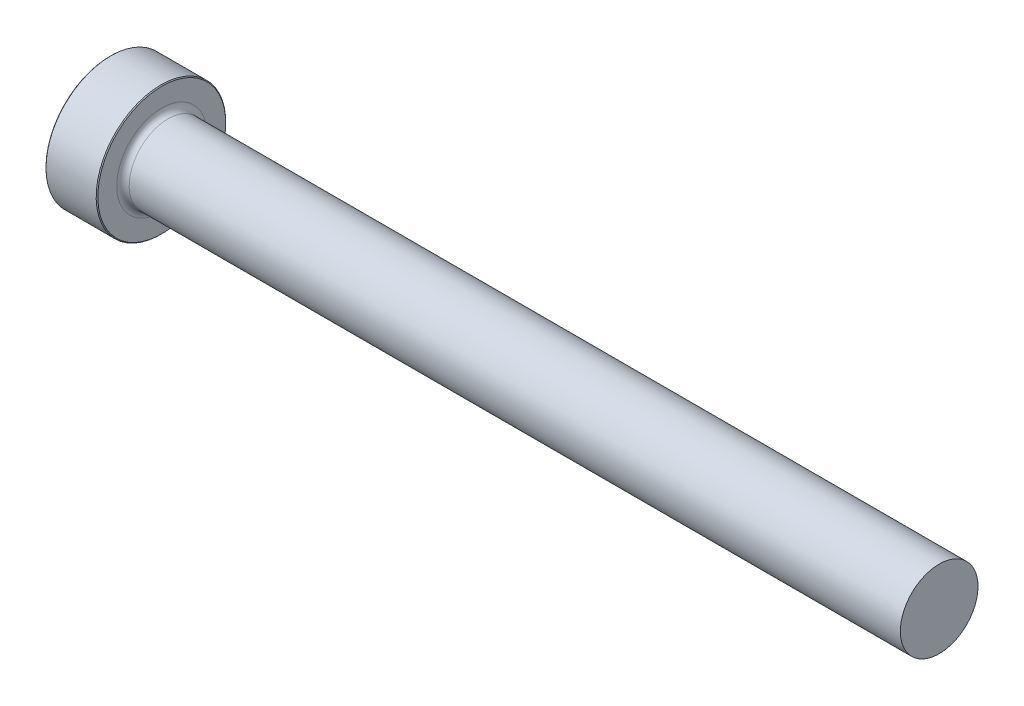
from build123d import *

# Parameters (mm, degrees)
CHAMFER1_SIZE = 0.1016


with BuildPart() as part:
    # Sketch1 → Revolve1 (revolve)
    with BuildSketch(Plane.XY):
        with BuildLine():
            Line((0, 0), (0, 7.9375))
            Line((0, 7.9375), (6.35, 7.9375))
            Line((6.35, 7.9375), (6.35, 5.52069))
            ThreePointArc((6.35, 5.52069), (6.573184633, 4.981874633), (7.112, 4.75869))
            Line((7.112, 4.75869), (101.6, 4.75869))
            Line((101.6, 4.75869), (101.6, 0))
            Line((101.6, 0), (0, 0))
        make_face()
    revolve(axis=Axis((101.6, 0, 0), (-1, 0, 0)))

    # Chamfer1
    chamfer1_edges = [part.edges().sort_by_distance(p)[0] for p in [
        (0, -7.9375, 0),
        (6.35, -7.9375, 0),
    ]]
    chamfer(chamfer1_edges, length=CHAMFER1_SIZE)


solid = part.part
